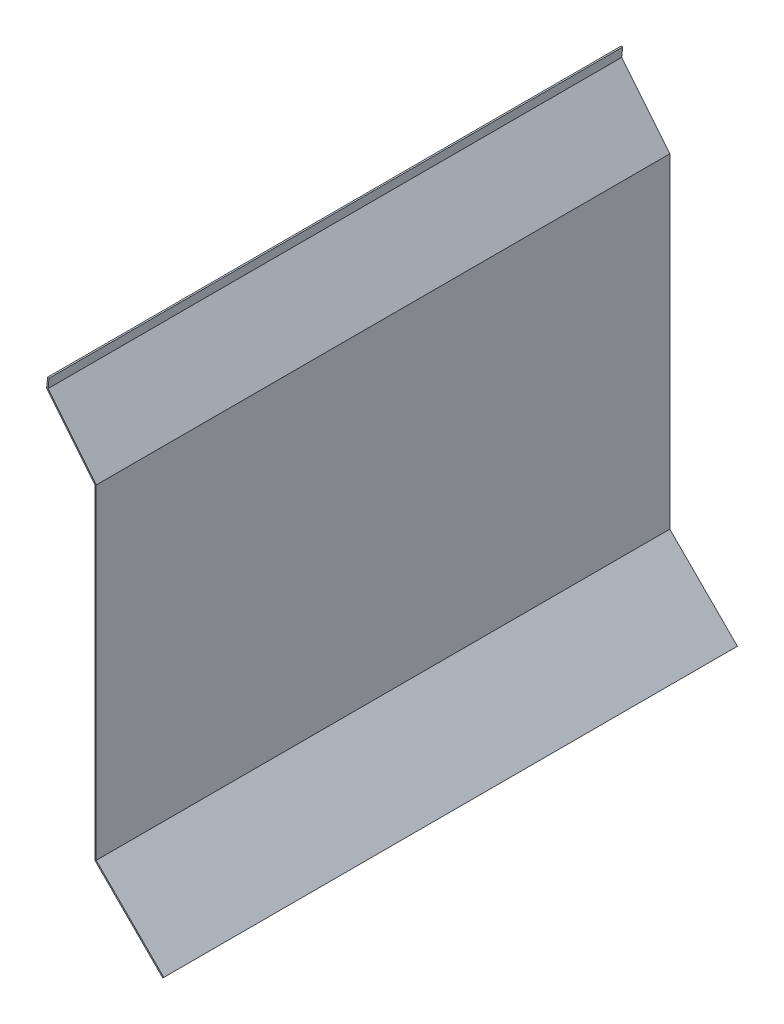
ISO-10303-21;
HEADER;
FILE_DESCRIPTION(('STEP AP214'),'2;1');
FILE_NAME('part.step','',(''),(''),'','','');
FILE_SCHEMA(('AUTOMOTIVE_DESIGN { 1 0 10303 214 1 1 1 1 }'));
ENDSEC;
DATA;
#1=APPLICATION_CONTEXT('core data for automotive mechanical design processes');
#2=APPLICATION_PROTOCOL_DEFINITION('international standard','automotive_design',2000,#1);
#3=PRODUCT_CONTEXT('',#1,'mechanical');
#4=PRODUCT('Part','Part','',(#3));
#5=PRODUCT_RELATED_PRODUCT_CATEGORY('part','',(#4));
#6=PRODUCT_DEFINITION_FORMATION('','',#4);
#7=PRODUCT_DEFINITION_CONTEXT('part definition',#1,'design');
#8=PRODUCT_DEFINITION('design','',#6,#7);
#9=PRODUCT_DEFINITION_SHAPE('','',#8);
#10=(LENGTH_UNIT() NAMED_UNIT(*) SI_UNIT(.MILLI.,.METRE.));
#11=(NAMED_UNIT(*) PLANE_ANGLE_UNIT() SI_UNIT($,.RADIAN.));
#12=(NAMED_UNIT(*) SI_UNIT($,.STERADIAN.) SOLID_ANGLE_UNIT());
#13=UNCERTAINTY_MEASURE_WITH_UNIT(LENGTH_MEASURE(1.E-05),#10,'distance_accuracy_value','');
#14=(GEOMETRIC_REPRESENTATION_CONTEXT(3) GLOBAL_UNCERTAINTY_ASSIGNED_CONTEXT((#13)) GLOBAL_UNIT_ASSIGNED_CONTEXT((#10,
#11,#12)) REPRESENTATION_CONTEXT('',''));
#15=CARTESIAN_POINT('',(0.,0.,0.));
#16=DIRECTION('',(0.,0.,1.));
#17=DIRECTION('',(1.,0.,0.));
#18=AXIS2_PLACEMENT_3D('',#15,#16,#17);
#19=CARTESIAN_POINT('',(-3670.67310213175,3490.45163258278,600.));
#20=DIRECTION('',(0.994521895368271,-0.104528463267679,0.));
#21=DIRECTION('',(0.104528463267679,0.994521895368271,0.));
#22=AXIS2_PLACEMENT_3D('',#19,#20,#21);
#23=PLANE('',#22);
#24=DIRECTION('',(-0.104528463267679,-0.994521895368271,0.));
#25=VECTOR('',#24,1.);
#26=CARTESIAN_POINT('',(-3670.67310213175,3490.45163258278,0.));
#27=LINE('',#26,#25);
#28=CARTESIAN_POINT('',(-3670.67310213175,3490.45163258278,0.));
#29=VERTEX_POINT('',#28);
#30=CARTESIAN_POINT('',(-3671.78333242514,3479.88849694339,0.));
#31=VERTEX_POINT('',#30);
#32=EDGE_CURVE('E104',#29,#31,#27,.T.);
#33=ORIENTED_EDGE('',*,*,#32,.T.);
#34=DIRECTION('',(0.,0.,-1.));
#35=VECTOR('',#34,1.);
#36=CARTESIAN_POINT('',(-3671.78333242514,3479.88849694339,600.));
#37=LINE('',#36,#35);
#38=CARTESIAN_POINT('',(-3671.78333242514,3479.88849694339,600.));
#39=VERTEX_POINT('',#38);
#40=EDGE_CURVE('E11',#39,#31,#37,.T.);
#41=ORIENTED_EDGE('',*,*,#40,.F.);
#42=DIRECTION('',(-0.104528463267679,-0.994521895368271,0.));
#43=VECTOR('',#42,1.);
#44=CARTESIAN_POINT('',(-3670.67310213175,3490.45163258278,600.));
#45=LINE('',#44,#43);
#46=CARTESIAN_POINT('',(-3670.67310213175,3490.45163258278,600.));
#47=VERTEX_POINT('',#46);
#48=EDGE_CURVE('E135',#47,#39,#45,.T.);
#49=ORIENTED_EDGE('',*,*,#48,.F.);
#50=DIRECTION('',(0.,0.,-1.));
#51=VECTOR('',#50,1.);
#52=CARTESIAN_POINT('',(-3670.67310213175,3490.45163258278,600.));
#53=LINE('',#52,#51);
#54=EDGE_CURVE('E117',#47,#29,#53,.T.);
#55=ORIENTED_EDGE('',*,*,#54,.T.);
#56=EDGE_LOOP('',(#33,#41,#49,#55));
#57=FACE_BOUND('',#56,.T.);
#58=ADVANCED_FACE('F24',(#57),#23,.F.);
#59=CARTESIAN_POINT('',(-3671.78333242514,3479.88849694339,600.));
#60=DIRECTION('',(0.77714596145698,0.629320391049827,0.));
#61=DIRECTION('',(-0.629320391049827,0.77714596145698,0.));
#62=AXIS2_PLACEMENT_3D('',#59,#60,#61);
#63=PLANE('',#62);
#64=DIRECTION('',(0.629320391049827,-0.77714596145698,0.));
#65=VECTOR('',#64,1.);
#66=CARTESIAN_POINT('',(-3671.78333242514,3479.88849694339,0.));
#67=LINE('',#66,#65);
#68=CARTESIAN_POINT('',(-3621.38097263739,3417.64676615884,0.));
#69=VERTEX_POINT('',#68);
#70=EDGE_CURVE('E100',#31,#69,#67,.T.);
#71=ORIENTED_EDGE('',*,*,#70,.T.);
#72=DIRECTION('',(0.,0.,-1.));
#73=VECTOR('',#72,1.);
#74=CARTESIAN_POINT('',(-3621.38097263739,3417.64676615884,600.));
#75=LINE('',#74,#73);
#76=CARTESIAN_POINT('',(-3621.38097263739,3417.64676615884,600.));
#77=VERTEX_POINT('',#76);
#78=EDGE_CURVE('E31',#77,#69,#75,.T.);
#79=ORIENTED_EDGE('',*,*,#78,.F.);
#80=DIRECTION('',(0.629320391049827,-0.77714596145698,0.));
#81=VECTOR('',#80,1.);
#82=CARTESIAN_POINT('',(-3671.78333242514,3479.88849694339,600.));
#83=LINE('',#82,#81);
#84=EDGE_CURVE('E113',#39,#77,#83,.T.);
#85=ORIENTED_EDGE('',*,*,#84,.F.);
#86=ORIENTED_EDGE('',*,*,#40,.T.);
#87=EDGE_LOOP('',(#71,#79,#85,#86));
#88=FACE_BOUND('',#87,.T.);
#89=ADVANCED_FACE('F112',(#88),#63,.F.);
#90=CARTESIAN_POINT('',(-3621.38097263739,3417.64676615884,600.));
#91=DIRECTION('',(1.,0.,0.));
#92=DIRECTION('',(0.,0.,-1.));
#93=AXIS2_PLACEMENT_3D('',#90,#91,#92);
#94=PLANE('',#93);
#95=DIRECTION('',(0.,-1.,0.));
#96=VECTOR('',#95,1.);
#97=CARTESIAN_POINT('',(-3621.38097263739,3417.64676615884,0.));
#98=LINE('',#97,#96);
#99=CARTESIAN_POINT('',(-3621.38097263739,3077.55662367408,0.));
#100=VERTEX_POINT('',#99);
#101=EDGE_CURVE('E106',#69,#100,#98,.T.);
#102=ORIENTED_EDGE('',*,*,#101,.T.);
#103=DIRECTION('',(0.,0.,-1.));
#104=VECTOR('',#103,1.);
#105=CARTESIAN_POINT('',(-3621.38097263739,3077.55662367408,600.));
#106=LINE('',#105,#104);
#107=CARTESIAN_POINT('',(-3621.38097263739,3077.55662367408,600.));
#108=VERTEX_POINT('',#107);
#109=EDGE_CURVE('E171',#108,#100,#106,.T.);
#110=ORIENTED_EDGE('',*,*,#109,.F.);
#111=DIRECTION('',(0.,-1.,0.));
#112=VECTOR('',#111,1.);
#113=CARTESIAN_POINT('',(-3621.38097263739,3417.64676615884,600.));
#114=LINE('',#113,#112);
#115=EDGE_CURVE('E138',#77,#108,#114,.T.);
#116=ORIENTED_EDGE('',*,*,#115,.F.);
#117=ORIENTED_EDGE('',*,*,#78,.T.);
#118=EDGE_LOOP('',(#102,#110,#116,#117));
#119=FACE_BOUND('',#118,.T.);
#120=ADVANCED_FACE('F175',(#119),#94,.F.);
#121=CARTESIAN_POINT('',(-3621.38097263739,3077.55662367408,600.));
#122=DIRECTION('',(0.707106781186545,0.70710678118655,0.));
#123=DIRECTION('',(-0.70710678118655,0.707106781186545,0.));
#124=AXIS2_PLACEMENT_3D('',#121,#122,#123);
#125=PLANE('',#124);
#126=DIRECTION('',(0.70710678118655,-0.707106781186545,0.));
#127=VECTOR('',#126,1.);
#128=CARTESIAN_POINT('',(-3621.38097263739,3077.55662367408,0.));
#129=LINE('',#128,#127);
#130=CARTESIAN_POINT('',(-3550.23095469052,3006.4066057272,0.));
#131=VERTEX_POINT('',#130);
#132=EDGE_CURVE('E121',#100,#131,#129,.T.);
#133=ORIENTED_EDGE('',*,*,#132,.T.);
#134=DIRECTION('',(0.,0.,-1.));
#135=VECTOR('',#134,1.);
#136=CARTESIAN_POINT('',(-3550.23095469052,3006.4066057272,600.));
#137=LINE('',#136,#135);
#138=CARTESIAN_POINT('',(-3550.23095469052,3006.4066057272,600.));
#139=VERTEX_POINT('',#138);
#140=EDGE_CURVE('E168',#139,#131,#137,.T.);
#141=ORIENTED_EDGE('',*,*,#140,.F.);
#142=DIRECTION('',(0.70710678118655,-0.707106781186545,0.));
#143=VECTOR('',#142,1.);
#144=CARTESIAN_POINT('',(-3621.38097263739,3077.55662367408,600.));
#145=LINE('',#144,#143);
#146=EDGE_CURVE('E140',#108,#139,#145,.T.);
#147=ORIENTED_EDGE('',*,*,#146,.F.);
#148=ORIENTED_EDGE('',*,*,#109,.T.);
#149=EDGE_LOOP('',(#133,#141,#147,#148));
#150=FACE_BOUND('',#149,.T.);
#151=ADVANCED_FACE('F183',(#150),#125,.F.);
#152=CARTESIAN_POINT('',(-3550.23095469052,3006.4066057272,600.));
#153=DIRECTION('',(-0.707106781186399,0.707106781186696,0.));
#154=DIRECTION('',(-0.707106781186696,-0.707106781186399,0.));
#155=AXIS2_PLACEMENT_3D('',#152,#153,#154);
#156=PLANE('',#155);
#157=DIRECTION('',(0.707106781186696,0.707106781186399,0.));
#158=VECTOR('',#157,1.);
#159=CARTESIAN_POINT('',(-3550.23095469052,3006.4066057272,0.));
#160=LINE('',#159,#158);
#161=CARTESIAN_POINT('',(-3549.17029451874,3007.46726589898,0.));
#162=VERTEX_POINT('',#161);
#163=EDGE_CURVE('E123',#131,#162,#160,.T.);
#164=ORIENTED_EDGE('',*,*,#163,.T.);
#165=DIRECTION('',(0.,0.,-1.));
#166=VECTOR('',#165,1.);
#167=CARTESIAN_POINT('',(-3549.17029451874,3007.46726589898,600.));
#168=LINE('',#167,#166);
#169=CARTESIAN_POINT('',(-3549.17029451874,3007.46726589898,600.));
#170=VERTEX_POINT('',#169);
#171=EDGE_CURVE('E165',#170,#162,#168,.T.);
#172=ORIENTED_EDGE('',*,*,#171,.F.);
#173=DIRECTION('',(0.707106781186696,0.707106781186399,0.));
#174=VECTOR('',#173,1.);
#175=CARTESIAN_POINT('',(-3550.23095469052,3006.4066057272,600.));
#176=LINE('',#175,#174);
#177=EDGE_CURVE('E142',#139,#170,#176,.T.);
#178=ORIENTED_EDGE('',*,*,#177,.F.);
#179=ORIENTED_EDGE('',*,*,#140,.T.);
#180=EDGE_LOOP('',(#164,#172,#178,#179));
#181=FACE_BOUND('',#180,.T.);
#182=ADVANCED_FACE('F186',(#181),#156,.F.);
#183=CARTESIAN_POINT('',(-3549.17029451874,3007.46726589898,600.));
#184=DIRECTION('',(-0.707106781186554,-0.707106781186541,0.));
#185=DIRECTION('',(0.707106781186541,-0.707106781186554,0.));
#186=AXIS2_PLACEMENT_3D('',#183,#184,#185);
#187=PLANE('',#186);
#188=DIRECTION('',(-0.707106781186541,0.707106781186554,0.));
#189=VECTOR('',#188,1.);
#190=CARTESIAN_POINT('',(-3549.17029451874,3007.46726589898,0.));
#191=LINE('',#190,#189);
#192=CARTESIAN_POINT('',(-3619.88097263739,3078.17794401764,0.));
#193=VERTEX_POINT('',#192);
#194=EDGE_CURVE('E125',#162,#193,#191,.T.);
#195=ORIENTED_EDGE('',*,*,#194,.T.);
#196=DIRECTION('',(0.,0.,-1.));
#197=VECTOR('',#196,1.);
#198=CARTESIAN_POINT('',(-3619.88097263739,3078.17794401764,600.));
#199=LINE('',#198,#197);
#200=CARTESIAN_POINT('',(-3619.88097263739,3078.17794401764,600.));
#201=VERTEX_POINT('',#200);
#202=EDGE_CURVE('E162',#201,#193,#199,.T.);
#203=ORIENTED_EDGE('',*,*,#202,.F.);
#204=DIRECTION('',(-0.707106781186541,0.707106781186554,0.));
#205=VECTOR('',#204,1.);
#206=CARTESIAN_POINT('',(-3549.17029451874,3007.46726589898,600.));
#207=LINE('',#206,#205);
#208=EDGE_CURVE('E144',#170,#201,#207,.T.);
#209=ORIENTED_EDGE('',*,*,#208,.F.);
#210=ORIENTED_EDGE('',*,*,#171,.T.);
#211=EDGE_LOOP('',(#195,#203,#209,#210));
#212=FACE_BOUND('',#211,.T.);
#213=ADVANCED_FACE('F191',(#212),#187,.F.);
#214=CARTESIAN_POINT('',(-3619.88097263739,3418.17794401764,600.));
#215=DIRECTION('',(-1.,0.,0.));
#216=DIRECTION('',(0.,0.,1.));
#217=AXIS2_PLACEMENT_3D('',#214,#215,#216);
#218=PLANE('',#217);
#219=DIRECTION('',(0.,1.,0.));
#220=VECTOR('',#219,1.);
#221=CARTESIAN_POINT('',(-3619.88097263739,3418.17794401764,0.));
#222=LINE('',#221,#220);
#223=CARTESIAN_POINT('',(-3619.88097263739,3418.17794401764,0.));
#224=VERTEX_POINT('',#223);
#225=EDGE_CURVE('E127',#193,#224,#222,.T.);
#226=ORIENTED_EDGE('',*,*,#225,.T.);
#227=DIRECTION('',(0.,0.,-1.));
#228=VECTOR('',#227,1.);
#229=CARTESIAN_POINT('',(-3619.88097263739,3418.17794401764,600.));
#230=LINE('',#229,#228);
#231=CARTESIAN_POINT('',(-3619.88097263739,3418.17794401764,600.));
#232=VERTEX_POINT('',#231);
#233=EDGE_CURVE('E159',#232,#224,#230,.T.);
#234=ORIENTED_EDGE('',*,*,#233,.F.);
#235=DIRECTION('',(0.,1.,0.));
#236=VECTOR('',#235,1.);
#237=CARTESIAN_POINT('',(-3619.88097263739,3418.17794401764,600.));
#238=LINE('',#237,#236);
#239=EDGE_CURVE('E146',#201,#232,#238,.T.);
#240=ORIENTED_EDGE('',*,*,#239,.F.);
#241=ORIENTED_EDGE('',*,*,#202,.T.);
#242=EDGE_LOOP('',(#226,#234,#240,#241));
#243=FACE_BOUND('',#242,.T.);
#244=ADVANCED_FACE('F197',(#243),#218,.F.);
#245=CARTESIAN_POINT('',(-3670.22660392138,3480.3496209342,600.));
#246=DIRECTION('',(-0.777145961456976,-0.629320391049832,0.));
#247=DIRECTION('',(0.629320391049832,-0.777145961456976,0.));
#248=AXIS2_PLACEMENT_3D('',#245,#246,#247);
#249=PLANE('',#248);
#250=DIRECTION('',(-0.629320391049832,0.777145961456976,0.));
#251=VECTOR('',#250,1.);
#252=CARTESIAN_POINT('',(-3670.22660392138,3480.3496209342,0.));
#253=LINE('',#252,#251);
#254=CARTESIAN_POINT('',(-3670.22660392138,3480.3496209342,0.));
#255=VERTEX_POINT('',#254);
#256=EDGE_CURVE('E129',#224,#255,#253,.T.);
#257=ORIENTED_EDGE('',*,*,#256,.T.);
#258=DIRECTION('',(0.,0.,-1.));
#259=VECTOR('',#258,1.);
#260=CARTESIAN_POINT('',(-3670.22660392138,3480.3496209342,600.));
#261=LINE('',#260,#259);
#262=CARTESIAN_POINT('',(-3670.22660392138,3480.3496209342,600.));
#263=VERTEX_POINT('',#262);
#264=EDGE_CURVE('E156',#263,#255,#261,.T.);
#265=ORIENTED_EDGE('',*,*,#264,.F.);
#266=DIRECTION('',(-0.629320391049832,0.777145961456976,0.));
#267=VECTOR('',#266,1.);
#268=CARTESIAN_POINT('',(-3670.22660392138,3480.3496209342,600.));
#269=LINE('',#268,#267);
#270=EDGE_CURVE('E148',#232,#263,#269,.T.);
#271=ORIENTED_EDGE('',*,*,#270,.F.);
#272=ORIENTED_EDGE('',*,*,#233,.T.);
#273=EDGE_LOOP('',(#257,#265,#271,#272));
#274=FACE_BOUND('',#273,.T.);
#275=ADVANCED_FACE('F201',(#274),#249,.F.);
#276=CARTESIAN_POINT('',(-3669.1813192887,3490.29483988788,600.));
#277=DIRECTION('',(-0.994521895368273,0.104528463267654,0.));
#278=DIRECTION('',(-0.104528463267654,-0.994521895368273,0.));
#279=AXIS2_PLACEMENT_3D('',#276,#277,#278);
#280=PLANE('',#279);
#281=DIRECTION('',(0.104528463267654,0.994521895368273,0.));
#282=VECTOR('',#281,1.);
#283=CARTESIAN_POINT('',(-3669.1813192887,3490.29483988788,0.));
#284=LINE('',#283,#282);
#285=CARTESIAN_POINT('',(-3669.1813192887,3490.29483988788,0.));
#286=VERTEX_POINT('',#285);
#287=EDGE_CURVE('E131',#255,#286,#284,.T.);
#288=ORIENTED_EDGE('',*,*,#287,.T.);
#289=DIRECTION('',(0.,0.,-1.));
#290=VECTOR('',#289,1.);
#291=CARTESIAN_POINT('',(-3669.1813192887,3490.29483988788,600.));
#292=LINE('',#291,#290);
#293=CARTESIAN_POINT('',(-3669.1813192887,3490.29483988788,600.));
#294=VERTEX_POINT('',#293);
#295=EDGE_CURVE('E153',#294,#286,#292,.T.);
#296=ORIENTED_EDGE('',*,*,#295,.F.);
#297=DIRECTION('',(0.104528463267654,0.994521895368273,0.));
#298=VECTOR('',#297,1.);
#299=CARTESIAN_POINT('',(-3669.1813192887,3490.29483988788,600.));
#300=LINE('',#299,#298);
#301=EDGE_CURVE('E43',#263,#294,#300,.T.);
#302=ORIENTED_EDGE('',*,*,#301,.F.);
#303=ORIENTED_EDGE('',*,*,#264,.T.);
#304=EDGE_LOOP('',(#288,#296,#302,#303));
#305=FACE_BOUND('',#304,.T.);
#306=ADVANCED_FACE('F204',(#305),#280,.F.);
#307=CARTESIAN_POINT('',(-3670.67310213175,3490.45163258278,600.));
#308=DIRECTION('',(-0.104528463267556,-0.994521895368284,0.));
#309=DIRECTION('',(0.994521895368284,-0.104528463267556,0.));
#310=AXIS2_PLACEMENT_3D('',#307,#308,#309);
#311=PLANE('',#310);
#312=DIRECTION('',(-0.994521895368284,0.104528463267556,0.));
#313=VECTOR('',#312,1.);
#314=CARTESIAN_POINT('',(-3670.67310213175,3490.45163258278,0.));
#315=LINE('',#314,#313);
#316=EDGE_CURVE('E133',#286,#29,#315,.T.);
#317=ORIENTED_EDGE('',*,*,#316,.T.);
#318=ORIENTED_EDGE('',*,*,#54,.F.);
#319=DIRECTION('',(-0.994521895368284,0.104528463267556,0.));
#320=VECTOR('',#319,1.);
#321=CARTESIAN_POINT('',(-3670.67310213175,3490.45163258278,600.));
#322=LINE('',#321,#320);
#323=EDGE_CURVE('E38',#294,#47,#322,.T.);
#324=ORIENTED_EDGE('',*,*,#323,.F.);
#325=ORIENTED_EDGE('',*,*,#295,.T.);
#326=EDGE_LOOP('',(#317,#318,#324,#325));
#327=FACE_BOUND('',#326,.T.);
#328=ADVANCED_FACE('F206',(#327),#311,.F.);
#329=CARTESIAN_POINT('',(-3670.67310213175,3490.45163258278,600.));
#330=DIRECTION('',(0.,0.,1.));
#331=DIRECTION('',(1.,0.,0.));
#332=AXIS2_PLACEMENT_3D('',#329,#330,#331);
#333=PLANE('',#332);
#334=ORIENTED_EDGE('',*,*,#48,.T.);
#335=ORIENTED_EDGE('',*,*,#84,.T.);
#336=ORIENTED_EDGE('',*,*,#115,.T.);
#337=ORIENTED_EDGE('',*,*,#146,.T.);
#338=ORIENTED_EDGE('',*,*,#177,.T.);
#339=ORIENTED_EDGE('',*,*,#208,.T.);
#340=ORIENTED_EDGE('',*,*,#239,.T.);
#341=ORIENTED_EDGE('',*,*,#270,.T.);
#342=ORIENTED_EDGE('',*,*,#301,.T.);
#343=ORIENTED_EDGE('',*,*,#323,.T.);
#344=EDGE_LOOP('',(#334,#335,#336,#337,#338,#339,#340,#341,#342,#343));
#345=FACE_BOUND('',#344,.T.);
#346=ADVANCED_FACE('F178',(#345),#333,.T.);
#347=CARTESIAN_POINT('',(-3670.67310213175,3490.45163258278,0.));
#348=DIRECTION('',(0.,0.,1.));
#349=DIRECTION('',(1.,0.,0.));
#350=AXIS2_PLACEMENT_3D('',#347,#348,#349);
#351=PLANE('',#350);
#352=ORIENTED_EDGE('',*,*,#32,.F.);
#353=ORIENTED_EDGE('',*,*,#316,.F.);
#354=ORIENTED_EDGE('',*,*,#287,.F.);
#355=ORIENTED_EDGE('',*,*,#256,.F.);
#356=ORIENTED_EDGE('',*,*,#225,.F.);
#357=ORIENTED_EDGE('',*,*,#194,.F.);
#358=ORIENTED_EDGE('',*,*,#163,.F.);
#359=ORIENTED_EDGE('',*,*,#132,.F.);
#360=ORIENTED_EDGE('',*,*,#101,.F.);
#361=ORIENTED_EDGE('',*,*,#70,.F.);
#362=EDGE_LOOP('',(#352,#353,#354,#355,#356,#357,#358,#359,#360,#361));
#363=FACE_BOUND('',#362,.T.);
#364=ADVANCED_FACE('F101',(#363),#351,.F.);
#365=CLOSED_SHELL('',(#58,#89,#120,#151,#182,#213,#244,#275,#306,#328,#346,#364));
#366=MANIFOLD_SOLID_BREP('B2',#365);
#367=ADVANCED_BREP_SHAPE_REPRESENTATION('',(#18,#366),#14);
#368=SHAPE_DEFINITION_REPRESENTATION(#9,#367);
ENDSEC;
END-ISO-10303-21;
